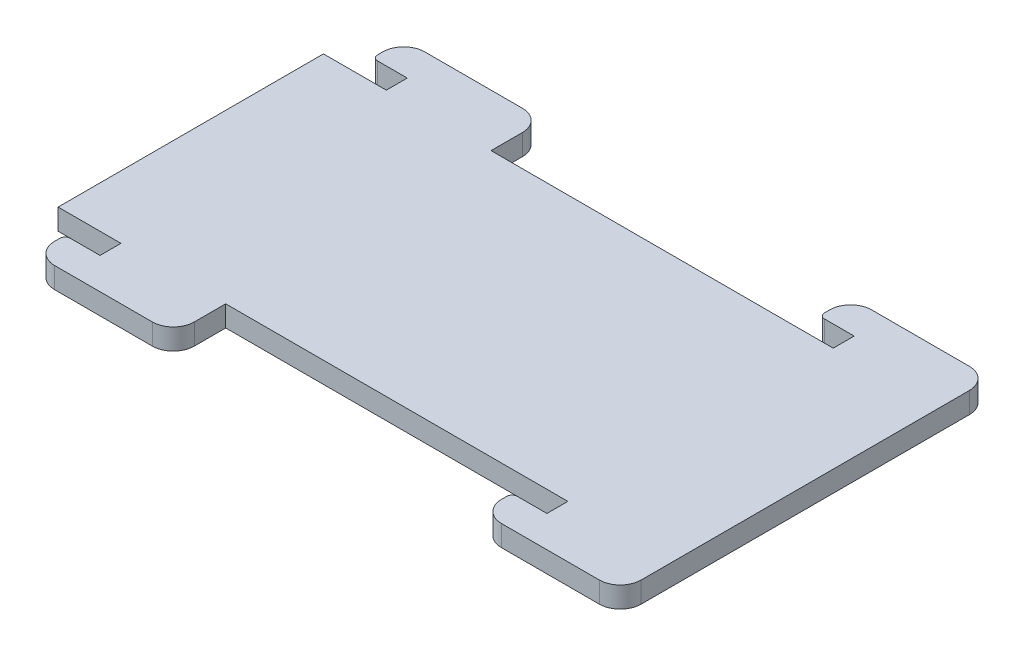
ISO-10303-21;
HEADER;
FILE_DESCRIPTION(('STEP AP214'),'2;1');
FILE_NAME('part.step','',(''),(''),'','','');
FILE_SCHEMA(('AUTOMOTIVE_DESIGN { 1 0 10303 214 1 1 1 1 }'));
ENDSEC;
DATA;
#1=APPLICATION_CONTEXT('core data for automotive mechanical design processes');
#2=APPLICATION_PROTOCOL_DEFINITION('international standard','automotive_design',2000,#1);
#3=PRODUCT_CONTEXT('',#1,'mechanical');
#4=PRODUCT('Part','Part','',(#3));
#5=PRODUCT_RELATED_PRODUCT_CATEGORY('part','',(#4));
#6=PRODUCT_DEFINITION_FORMATION('','',#4);
#7=PRODUCT_DEFINITION_CONTEXT('part definition',#1,'design');
#8=PRODUCT_DEFINITION('design','',#6,#7);
#9=PRODUCT_DEFINITION_SHAPE('','',#8);
#10=(LENGTH_UNIT() NAMED_UNIT(*) SI_UNIT(.MILLI.,.METRE.));
#11=(NAMED_UNIT(*) PLANE_ANGLE_UNIT() SI_UNIT($,.RADIAN.));
#12=(NAMED_UNIT(*) SI_UNIT($,.STERADIAN.) SOLID_ANGLE_UNIT());
#13=UNCERTAINTY_MEASURE_WITH_UNIT(LENGTH_MEASURE(1.E-05),#10,'distance_accuracy_value','');
#14=(GEOMETRIC_REPRESENTATION_CONTEXT(3) GLOBAL_UNCERTAINTY_ASSIGNED_CONTEXT((#13)) GLOBAL_UNIT_ASSIGNED_CONTEXT((#10,
#11,#12)) REPRESENTATION_CONTEXT('',''));
#15=CARTESIAN_POINT('',(0.,0.,0.));
#16=DIRECTION('',(0.,0.,1.));
#17=DIRECTION('',(1.,0.,0.));
#18=AXIS2_PLACEMENT_3D('',#15,#16,#17);
#19=CARTESIAN_POINT('',(0.,3.,0.));
#20=DIRECTION('',(1.,0.,0.));
#21=DIRECTION('',(0.,0.,-1.));
#22=AXIS2_PLACEMENT_3D('',#19,#20,#21);
#23=PLANE('',#22);
#24=DIRECTION('',(0.,0.,1.));
#25=VECTOR('',#24,1.);
#26=CARTESIAN_POINT('',(0.,0.,0.));
#27=LINE('',#26,#25);
#28=CARTESIAN_POINT('',(0.,0.,-38.));
#29=VERTEX_POINT('',#28);
#30=CARTESIAN_POINT('',(0.,0.,0.));
#31=VERTEX_POINT('',#30);
#32=EDGE_CURVE('E294',#29,#31,#27,.T.);
#33=ORIENTED_EDGE('',*,*,#32,.T.);
#34=DIRECTION('',(0.,-1.,0.));
#35=VECTOR('',#34,1.);
#36=CARTESIAN_POINT('',(0.,3.,0.));
#37=LINE('',#36,#35);
#38=CARTESIAN_POINT('',(0.,3.,0.));
#39=VERTEX_POINT('',#38);
#40=EDGE_CURVE('E275',#39,#31,#37,.T.);
#41=ORIENTED_EDGE('',*,*,#40,.F.);
#42=DIRECTION('',(0.,0.,1.));
#43=VECTOR('',#42,1.);
#44=CARTESIAN_POINT('',(0.,3.,0.));
#45=LINE('',#44,#43);
#46=CARTESIAN_POINT('',(0.,3.,-38.));
#47=VERTEX_POINT('',#46);
#48=EDGE_CURVE('E281',#47,#39,#45,.T.);
#49=ORIENTED_EDGE('',*,*,#48,.F.);
#50=DIRECTION('',(0.,-1.,0.));
#51=VECTOR('',#50,1.);
#52=CARTESIAN_POINT('',(0.,3.,-38.));
#53=LINE('',#52,#51);
#54=EDGE_CURVE('E432',#47,#29,#53,.T.);
#55=ORIENTED_EDGE('',*,*,#54,.T.);
#56=EDGE_LOOP('',(#33,#41,#49,#55));
#57=FACE_BOUND('',#56,.T.);
#58=ADVANCED_FACE('F37',(#57),#23,.F.);
#59=CARTESIAN_POINT('',(0.,3.,0.));
#60=DIRECTION('',(0.,0.,-1.));
#61=DIRECTION('',(-1.,0.,0.));
#62=AXIS2_PLACEMENT_3D('',#59,#60,#61);
#63=PLANE('',#62);
#64=DIRECTION('',(1.,0.,0.));
#65=VECTOR('',#64,1.);
#66=CARTESIAN_POINT('',(0.,0.,0.));
#67=LINE('',#66,#65);
#68=CARTESIAN_POINT('',(8.99999999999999,0.,0.));
#69=VERTEX_POINT('',#68);
#70=EDGE_CURVE('E470',#31,#69,#67,.T.);
#71=ORIENTED_EDGE('',*,*,#70,.T.);
#72=DIRECTION('',(0.,-1.,0.));
#73=VECTOR('',#72,1.);
#74=CARTESIAN_POINT('',(8.99999999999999,3.,0.));
#75=LINE('',#74,#73);
#76=CARTESIAN_POINT('',(8.99999999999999,3.,0.));
#77=VERTEX_POINT('',#76);
#78=EDGE_CURVE('E278',#77,#69,#75,.T.);
#79=ORIENTED_EDGE('',*,*,#78,.F.);
#80=DIRECTION('',(1.,0.,0.));
#81=VECTOR('',#80,1.);
#82=CARTESIAN_POINT('',(0.,3.,0.));
#83=LINE('',#82,#81);
#84=EDGE_CURVE('E271',#39,#77,#83,.T.);
#85=ORIENTED_EDGE('',*,*,#84,.F.);
#86=ORIENTED_EDGE('',*,*,#40,.T.);
#87=EDGE_LOOP('',(#71,#79,#85,#86));
#88=FACE_BOUND('',#87,.T.);
#89=ADVANCED_FACE('F273',(#88),#63,.F.);
#90=CARTESIAN_POINT('',(8.99999999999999,3.,0.));
#91=DIRECTION('',(1.,0.,0.));
#92=DIRECTION('',(0.,0.,-1.));
#93=AXIS2_PLACEMENT_3D('',#90,#91,#92);
#94=PLANE('',#93);
#95=DIRECTION('',(0.,0.,1.));
#96=VECTOR('',#95,1.);
#97=CARTESIAN_POINT('',(8.99999999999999,0.,0.));
#98=LINE('',#97,#96);
#99=CARTESIAN_POINT('',(8.99999999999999,0.,3.));
#100=VERTEX_POINT('',#99);
#101=EDGE_CURVE('E464',#69,#100,#98,.T.);
#102=ORIENTED_EDGE('',*,*,#101,.T.);
#103=DIRECTION('',(0.,-1.,0.));
#104=VECTOR('',#103,1.);
#105=CARTESIAN_POINT('',(8.99999999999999,3.,3.));
#106=LINE('',#105,#104);
#107=CARTESIAN_POINT('',(8.99999999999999,3.,3.));
#108=VERTEX_POINT('',#107);
#109=EDGE_CURVE('E299',#108,#100,#106,.T.);
#110=ORIENTED_EDGE('',*,*,#109,.F.);
#111=DIRECTION('',(0.,0.,1.));
#112=VECTOR('',#111,1.);
#113=CARTESIAN_POINT('',(8.99999999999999,3.,0.));
#114=LINE('',#113,#112);
#115=EDGE_CURVE('E280',#77,#108,#114,.T.);
#116=ORIENTED_EDGE('',*,*,#115,.F.);
#117=ORIENTED_EDGE('',*,*,#78,.T.);
#118=EDGE_LOOP('',(#102,#110,#116,#117));
#119=FACE_BOUND('',#118,.T.);
#120=ADVANCED_FACE('F536',(#119),#94,.F.);
#121=CARTESIAN_POINT('',(8.99999999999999,3.,3.));
#122=DIRECTION('',(0.,0.,1.));
#123=DIRECTION('',(1.,0.,0.));
#124=AXIS2_PLACEMENT_3D('',#121,#122,#123);
#125=PLANE('',#124);
#126=DIRECTION('',(-1.,0.,0.));
#127=VECTOR('',#126,1.);
#128=CARTESIAN_POINT('',(8.99999999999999,0.,3.));
#129=LINE('',#128,#127);
#130=CARTESIAN_POINT('',(4.75,0.,3.));
#131=VERTEX_POINT('',#130);
#132=EDGE_CURVE('E460',#100,#131,#129,.T.);
#133=ORIENTED_EDGE('',*,*,#132,.T.);
#134=DIRECTION('',(0.,-1.,0.));
#135=VECTOR('',#134,1.);
#136=CARTESIAN_POINT('',(4.75,3.,3.));
#137=LINE('',#136,#135);
#138=CARTESIAN_POINT('',(4.75,3.,3.));
#139=VERTEX_POINT('',#138);
#140=EDGE_CURVE('E60',#131,#139,#137,.F.);
#141=ORIENTED_EDGE('',*,*,#140,.T.);
#142=DIRECTION('',(-1.,0.,0.));
#143=VECTOR('',#142,1.);
#144=CARTESIAN_POINT('',(8.99999999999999,3.,3.));
#145=LINE('',#144,#143);
#146=EDGE_CURVE('E461',#108,#139,#145,.T.);
#147=ORIENTED_EDGE('',*,*,#146,.F.);
#148=ORIENTED_EDGE('',*,*,#109,.T.);
#149=EDGE_LOOP('',(#133,#141,#147,#148));
#150=FACE_BOUND('',#149,.T.);
#151=ADVANCED_FACE('F459',(#150),#125,.F.);
#152=CARTESIAN_POINT('',(4.,3.,3.));
#153=DIRECTION('',(1.,0.,0.));
#154=DIRECTION('',(0.,0.,-1.));
#155=AXIS2_PLACEMENT_3D('',#152,#153,#154);
#156=PLANE('',#155);
#157=DIRECTION('',(0.,0.,1.));
#158=VECTOR('',#157,1.);
#159=CARTESIAN_POINT('',(4.,3.,3.));
#160=LINE('',#159,#158);
#161=CARTESIAN_POINT('',(4.,3.,3.75));
#162=VERTEX_POINT('',#161);
#163=CARTESIAN_POINT('',(4.,3.,4.5));
#164=VERTEX_POINT('',#163);
#165=EDGE_CURVE('E538',#162,#164,#160,.T.);
#166=ORIENTED_EDGE('',*,*,#165,.F.);
#167=DIRECTION('',(0.,-1.,0.));
#168=VECTOR('',#167,1.);
#169=CARTESIAN_POINT('',(4.,3.,3.75));
#170=LINE('',#169,#168);
#171=CARTESIAN_POINT('',(4.,0.,3.75));
#172=VERTEX_POINT('',#171);
#173=EDGE_CURVE('E396',#162,#172,#170,.T.);
#174=ORIENTED_EDGE('',*,*,#173,.T.);
#175=DIRECTION('',(0.,0.,1.));
#176=VECTOR('',#175,1.);
#177=CARTESIAN_POINT('',(4.,0.,3.));
#178=LINE('',#177,#176);
#179=CARTESIAN_POINT('',(4.,0.,4.5));
#180=VERTEX_POINT('',#179);
#181=EDGE_CURVE('E466',#172,#180,#178,.T.);
#182=ORIENTED_EDGE('',*,*,#181,.T.);
#183=DIRECTION('',(0.,-1.,0.));
#184=VECTOR('',#183,1.);
#185=CARTESIAN_POINT('',(4.,3.,4.5));
#186=LINE('',#185,#184);
#187=EDGE_CURVE('E352',#180,#164,#186,.F.);
#188=ORIENTED_EDGE('',*,*,#187,.T.);
#189=EDGE_LOOP('',(#166,#174,#182,#188));
#190=FACE_BOUND('',#189,.T.);
#191=ADVANCED_FACE('F678',(#190),#156,.F.);
#192=CARTESIAN_POINT('',(24.,3.,7.5));
#193=DIRECTION('',(0.,0.,-1.));
#194=DIRECTION('',(-1.,0.,0.));
#195=AXIS2_PLACEMENT_3D('',#192,#193,#194);
#196=PLANE('',#195);
#197=DIRECTION('',(1.,0.,0.));
#198=VECTOR('',#197,1.);
#199=CARTESIAN_POINT('',(24.,3.,7.5));
#200=LINE('',#199,#198);
#201=CARTESIAN_POINT('',(7.,3.,7.5));
#202=VERTEX_POINT('',#201);
#203=CARTESIAN_POINT('',(21.,3.,7.5));
#204=VERTEX_POINT('',#203);
#205=EDGE_CURVE('E542',#202,#204,#200,.T.);
#206=ORIENTED_EDGE('',*,*,#205,.F.);
#207=DIRECTION('',(0.,-1.,0.));
#208=VECTOR('',#207,1.);
#209=CARTESIAN_POINT('',(7.,3.,7.5));
#210=LINE('',#209,#208);
#211=CARTESIAN_POINT('',(7.,0.,7.5));
#212=VERTEX_POINT('',#211);
#213=EDGE_CURVE('E349',#202,#212,#210,.T.);
#214=ORIENTED_EDGE('',*,*,#213,.T.);
#215=DIRECTION('',(1.,0.,0.));
#216=VECTOR('',#215,1.);
#217=CARTESIAN_POINT('',(24.,0.,7.5));
#218=LINE('',#217,#216);
#219=CARTESIAN_POINT('',(21.,0.,7.5));
#220=VERTEX_POINT('',#219);
#221=EDGE_CURVE('E468',#212,#220,#218,.T.);
#222=ORIENTED_EDGE('',*,*,#221,.T.);
#223=DIRECTION('',(0.,-1.,0.));
#224=VECTOR('',#223,1.);
#225=CARTESIAN_POINT('',(21.,3.,7.5));
#226=LINE('',#225,#224);
#227=EDGE_CURVE('E347',#220,#204,#226,.F.);
#228=ORIENTED_EDGE('',*,*,#227,.T.);
#229=EDGE_LOOP('',(#206,#214,#222,#228));
#230=FACE_BOUND('',#229,.T.);
#231=ADVANCED_FACE('F671',(#230),#196,.F.);
#232=CARTESIAN_POINT('',(24.,3.,0.));
#233=DIRECTION('',(-1.,0.,0.));
#234=DIRECTION('',(0.,0.,1.));
#235=AXIS2_PLACEMENT_3D('',#232,#233,#234);
#236=PLANE('',#235);
#237=DIRECTION('',(0.,0.,-1.));
#238=VECTOR('',#237,1.);
#239=CARTESIAN_POINT('',(24.,3.,3.));
#240=LINE('',#239,#238);
#241=CARTESIAN_POINT('',(24.,3.,4.5));
#242=VERTEX_POINT('',#241);
#243=CARTESIAN_POINT('',(24.,3.,0.));
#244=VERTEX_POINT('',#243);
#245=EDGE_CURVE('E545',#242,#244,#240,.T.);
#246=ORIENTED_EDGE('',*,*,#245,.F.);
#247=DIRECTION('',(0.,-1.,0.));
#248=VECTOR('',#247,1.);
#249=CARTESIAN_POINT('',(24.,3.,4.5));
#250=LINE('',#249,#248);
#251=CARTESIAN_POINT('',(24.,0.,4.5));
#252=VERTEX_POINT('',#251);
#253=EDGE_CURVE('E355',#242,#252,#250,.T.);
#254=ORIENTED_EDGE('',*,*,#253,.T.);
#255=DIRECTION('',(0.,0.,-1.));
#256=VECTOR('',#255,1.);
#257=CARTESIAN_POINT('',(24.,0.,0.));
#258=LINE('',#257,#256);
#259=CARTESIAN_POINT('',(24.,0.,0.));
#260=VERTEX_POINT('',#259);
#261=EDGE_CURVE('E476',#252,#260,#258,.T.);
#262=ORIENTED_EDGE('',*,*,#261,.T.);
#263=DIRECTION('',(0.,-1.,0.));
#264=VECTOR('',#263,1.);
#265=CARTESIAN_POINT('',(24.,3.,0.));
#266=LINE('',#265,#264);
#267=EDGE_CURVE('E454',#244,#260,#266,.T.);
#268=ORIENTED_EDGE('',*,*,#267,.F.);
#269=EDGE_LOOP('',(#246,#254,#262,#268));
#270=FACE_BOUND('',#269,.T.);
#271=ADVANCED_FACE('F662',(#270),#236,.F.);
#272=CARTESIAN_POINT('',(24.,3.,0.));
#273=DIRECTION('',(0.,0.,-1.));
#274=DIRECTION('',(-1.,0.,0.));
#275=AXIS2_PLACEMENT_3D('',#272,#273,#274);
#276=PLANE('',#275);
#277=DIRECTION('',(1.,0.,0.));
#278=VECTOR('',#277,1.);
#279=CARTESIAN_POINT('',(24.,0.,0.));
#280=LINE('',#279,#278);
#281=CARTESIAN_POINT('',(73.,0.,0.));
#282=VERTEX_POINT('',#281);
#283=EDGE_CURVE('E478',#260,#282,#280,.T.);
#284=ORIENTED_EDGE('',*,*,#283,.T.);
#285=DIRECTION('',(0.,-1.,0.));
#286=VECTOR('',#285,1.);
#287=CARTESIAN_POINT('',(73.,3.,0.));
#288=LINE('',#287,#286);
#289=CARTESIAN_POINT('',(73.,3.,0.));
#290=VERTEX_POINT('',#289);
#291=EDGE_CURVE('E451',#290,#282,#288,.T.);
#292=ORIENTED_EDGE('',*,*,#291,.F.);
#293=DIRECTION('',(1.,0.,0.));
#294=VECTOR('',#293,1.);
#295=CARTESIAN_POINT('',(24.,3.,0.));
#296=LINE('',#295,#294);
#297=EDGE_CURVE('E547',#244,#290,#296,.T.);
#298=ORIENTED_EDGE('',*,*,#297,.F.);
#299=ORIENTED_EDGE('',*,*,#267,.T.);
#300=EDGE_LOOP('',(#284,#292,#298,#299));
#301=FACE_BOUND('',#300,.T.);
#302=ADVANCED_FACE('F658',(#301),#276,.F.);
#303=CARTESIAN_POINT('',(73.,3.,0.));
#304=DIRECTION('',(1.,0.,0.));
#305=DIRECTION('',(0.,0.,-1.));
#306=AXIS2_PLACEMENT_3D('',#303,#304,#305);
#307=PLANE('',#306);
#308=DIRECTION('',(0.,0.,1.));
#309=VECTOR('',#308,1.);
#310=CARTESIAN_POINT('',(73.,0.,0.));
#311=LINE('',#310,#309);
#312=CARTESIAN_POINT('',(73.,0.,3.));
#313=VERTEX_POINT('',#312);
#314=EDGE_CURVE('E480',#282,#313,#311,.T.);
#315=ORIENTED_EDGE('',*,*,#314,.T.);
#316=DIRECTION('',(0.,-1.,0.));
#317=VECTOR('',#316,1.);
#318=CARTESIAN_POINT('',(73.,3.,3.));
#319=LINE('',#318,#317);
#320=CARTESIAN_POINT('',(73.,3.,3.));
#321=VERTEX_POINT('',#320);
#322=EDGE_CURVE('E448',#321,#313,#319,.T.);
#323=ORIENTED_EDGE('',*,*,#322,.F.);
#324=DIRECTION('',(0.,0.,1.));
#325=VECTOR('',#324,1.);
#326=CARTESIAN_POINT('',(73.,3.,0.));
#327=LINE('',#326,#325);
#328=EDGE_CURVE('E549',#290,#321,#327,.T.);
#329=ORIENTED_EDGE('',*,*,#328,.F.);
#330=ORIENTED_EDGE('',*,*,#291,.T.);
#331=EDGE_LOOP('',(#315,#323,#329,#330));
#332=FACE_BOUND('',#331,.T.);
#333=ADVANCED_FACE('F653',(#332),#307,.F.);
#334=CARTESIAN_POINT('',(73.,3.,3.));
#335=DIRECTION('',(0.,0.,1.));
#336=DIRECTION('',(1.,0.,0.));
#337=AXIS2_PLACEMENT_3D('',#334,#335,#336);
#338=PLANE('',#337);
#339=DIRECTION('',(-1.,0.,0.));
#340=VECTOR('',#339,1.);
#341=CARTESIAN_POINT('',(73.,0.,3.));
#342=LINE('',#341,#340);
#343=CARTESIAN_POINT('',(68.75,0.,3.));
#344=VERTEX_POINT('',#343);
#345=EDGE_CURVE('E482',#313,#344,#342,.T.);
#346=ORIENTED_EDGE('',*,*,#345,.T.);
#347=DIRECTION('',(0.,-1.,0.));
#348=VECTOR('',#347,1.);
#349=CARTESIAN_POINT('',(68.75,3.,3.));
#350=LINE('',#349,#348);
#351=CARTESIAN_POINT('',(68.75,3.,3.));
#352=VERTEX_POINT('',#351);
#353=EDGE_CURVE('E387',#344,#352,#350,.F.);
#354=ORIENTED_EDGE('',*,*,#353,.T.);
#355=DIRECTION('',(-1.,0.,0.));
#356=VECTOR('',#355,1.);
#357=CARTESIAN_POINT('',(73.,3.,3.));
#358=LINE('',#357,#356);
#359=EDGE_CURVE('E551',#321,#352,#358,.T.);
#360=ORIENTED_EDGE('',*,*,#359,.F.);
#361=ORIENTED_EDGE('',*,*,#322,.T.);
#362=EDGE_LOOP('',(#346,#354,#360,#361));
#363=FACE_BOUND('',#362,.T.);
#364=ADVANCED_FACE('F647',(#363),#338,.F.);
#365=CARTESIAN_POINT('',(68.,3.,3.));
#366=DIRECTION('',(1.,0.,0.));
#367=DIRECTION('',(0.,0.,-1.));
#368=AXIS2_PLACEMENT_3D('',#365,#366,#367);
#369=PLANE('',#368);
#370=DIRECTION('',(0.,0.,1.));
#371=VECTOR('',#370,1.);
#372=CARTESIAN_POINT('',(68.,3.,3.));
#373=LINE('',#372,#371);
#374=CARTESIAN_POINT('',(68.,3.,3.75));
#375=VERTEX_POINT('',#374);
#376=CARTESIAN_POINT('',(68.,3.,4.5));
#377=VERTEX_POINT('',#376);
#378=EDGE_CURVE('E553',#375,#377,#373,.T.);
#379=ORIENTED_EDGE('',*,*,#378,.F.);
#380=DIRECTION('',(0.,-1.,0.));
#381=VECTOR('',#380,1.);
#382=CARTESIAN_POINT('',(68.,3.,3.75));
#383=LINE('',#382,#381);
#384=CARTESIAN_POINT('',(68.,0.,3.75));
#385=VERTEX_POINT('',#384);
#386=EDGE_CURVE('E376',#375,#385,#383,.T.);
#387=ORIENTED_EDGE('',*,*,#386,.T.);
#388=DIRECTION('',(0.,0.,1.));
#389=VECTOR('',#388,1.);
#390=CARTESIAN_POINT('',(68.,0.,3.));
#391=LINE('',#390,#389);
#392=CARTESIAN_POINT('',(68.,0.,4.5));
#393=VERTEX_POINT('',#392);
#394=EDGE_CURVE('E485',#385,#393,#391,.T.);
#395=ORIENTED_EDGE('',*,*,#394,.T.);
#396=DIRECTION('',(0.,-1.,0.));
#397=VECTOR('',#396,1.);
#398=CARTESIAN_POINT('',(68.,3.,4.5));
#399=LINE('',#398,#397);
#400=EDGE_CURVE('E344',#393,#377,#399,.F.);
#401=ORIENTED_EDGE('',*,*,#400,.T.);
#402=EDGE_LOOP('',(#379,#387,#395,#401));
#403=FACE_BOUND('',#402,.T.);
#404=ADVANCED_FACE('F639',(#403),#369,.F.);
#405=CARTESIAN_POINT('',(88.,3.,7.5));
#406=DIRECTION('',(0.,0.,-1.));
#407=DIRECTION('',(-1.,0.,0.));
#408=AXIS2_PLACEMENT_3D('',#405,#406,#407);
#409=PLANE('',#408);
#410=DIRECTION('',(1.,0.,0.));
#411=VECTOR('',#410,1.);
#412=CARTESIAN_POINT('',(88.,0.,7.5));
#413=LINE('',#412,#411);
#414=CARTESIAN_POINT('',(71.,0.,7.5));
#415=VERTEX_POINT('',#414);
#416=CARTESIAN_POINT('',(85.,0.,7.5));
#417=VERTEX_POINT('',#416);
#418=EDGE_CURVE('E487',#415,#417,#413,.T.);
#419=ORIENTED_EDGE('',*,*,#418,.T.);
#420=DIRECTION('',(0.,-1.,0.));
#421=VECTOR('',#420,1.);
#422=CARTESIAN_POINT('',(85.,3.,7.5));
#423=LINE('',#422,#421);
#424=CARTESIAN_POINT('',(85.,3.,7.5));
#425=VERTEX_POINT('',#424);
#426=EDGE_CURVE('E326',#417,#425,#423,.F.);
#427=ORIENTED_EDGE('',*,*,#426,.T.);
#428=DIRECTION('',(1.,0.,0.));
#429=VECTOR('',#428,1.);
#430=CARTESIAN_POINT('',(88.,3.,7.5));
#431=LINE('',#430,#429);
#432=CARTESIAN_POINT('',(71.,3.,7.5));
#433=VERTEX_POINT('',#432);
#434=EDGE_CURVE('E555',#433,#425,#431,.T.);
#435=ORIENTED_EDGE('',*,*,#434,.F.);
#436=DIRECTION('',(0.,-1.,0.));
#437=VECTOR('',#436,1.);
#438=CARTESIAN_POINT('',(71.,3.,7.5));
#439=LINE('',#438,#437);
#440=EDGE_CURVE('E323',#433,#415,#439,.T.);
#441=ORIENTED_EDGE('',*,*,#440,.T.);
#442=EDGE_LOOP('',(#419,#427,#435,#441));
#443=FACE_BOUND('',#442,.T.);
#444=ADVANCED_FACE('F629',(#443),#409,.F.);
#445=CARTESIAN_POINT('',(88.,3.,-41.));
#446=DIRECTION('',(-1.,0.,0.));
#447=DIRECTION('',(0.,0.,1.));
#448=AXIS2_PLACEMENT_3D('',#445,#446,#447);
#449=PLANE('',#448);
#450=DIRECTION('',(0.,0.,-1.));
#451=VECTOR('',#450,1.);
#452=CARTESIAN_POINT('',(88.,3.,3.));
#453=LINE('',#452,#451);
#454=CARTESIAN_POINT('',(88.,3.,4.5));
#455=VERTEX_POINT('',#454);
#456=CARTESIAN_POINT('',(88.,3.,-42.5));
#457=VERTEX_POINT('',#456);
#458=EDGE_CURVE('E558',#455,#457,#453,.T.);
#459=ORIENTED_EDGE('',*,*,#458,.F.);
#460=DIRECTION('',(0.,-1.,0.));
#461=VECTOR('',#460,1.);
#462=CARTESIAN_POINT('',(88.,3.,4.5));
#463=LINE('',#462,#461);
#464=CARTESIAN_POINT('',(88.,0.,4.5));
#465=VERTEX_POINT('',#464);
#466=EDGE_CURVE('E297',#455,#465,#463,.T.);
#467=ORIENTED_EDGE('',*,*,#466,.T.);
#468=DIRECTION('',(0.,0.,-1.));
#469=VECTOR('',#468,1.);
#470=CARTESIAN_POINT('',(88.,0.,-41.));
#471=LINE('',#470,#469);
#472=CARTESIAN_POINT('',(88.,0.,-42.5));
#473=VERTEX_POINT('',#472);
#474=EDGE_CURVE('E490',#465,#473,#471,.T.);
#475=ORIENTED_EDGE('',*,*,#474,.T.);
#476=DIRECTION('',(0.,-1.,0.));
#477=VECTOR('',#476,1.);
#478=CARTESIAN_POINT('',(88.,3.,-42.5));
#479=LINE('',#478,#477);
#480=EDGE_CURVE('E295',#473,#457,#479,.F.);
#481=ORIENTED_EDGE('',*,*,#480,.T.);
#482=EDGE_LOOP('',(#459,#467,#475,#481));
#483=FACE_BOUND('',#482,.T.);
#484=ADVANCED_FACE('F621',(#483),#449,.F.);
#485=CARTESIAN_POINT('',(88.,3.,-45.5));
#486=DIRECTION('',(0.,0.,1.));
#487=DIRECTION('',(1.,0.,0.));
#488=AXIS2_PLACEMENT_3D('',#485,#486,#487);
#489=PLANE('',#488);
#490=DIRECTION('',(-1.,0.,0.));
#491=VECTOR('',#490,1.);
#492=CARTESIAN_POINT('',(88.,3.,-45.5));
#493=LINE('',#492,#491);
#494=CARTESIAN_POINT('',(85.,3.,-45.5));
#495=VERTEX_POINT('',#494);
#496=CARTESIAN_POINT('',(71.,3.,-45.5));
#497=VERTEX_POINT('',#496);
#498=EDGE_CURVE('E561',#495,#497,#493,.T.);
#499=ORIENTED_EDGE('',*,*,#498,.F.);
#500=DIRECTION('',(0.,-1.,0.));
#501=VECTOR('',#500,1.);
#502=CARTESIAN_POINT('',(85.,3.,-45.5));
#503=LINE('',#502,#501);
#504=CARTESIAN_POINT('',(85.,0.,-45.5));
#505=VERTEX_POINT('',#504);
#506=EDGE_CURVE('E368',#495,#505,#503,.T.);
#507=ORIENTED_EDGE('',*,*,#506,.T.);
#508=DIRECTION('',(-1.,0.,0.));
#509=VECTOR('',#508,1.);
#510=CARTESIAN_POINT('',(88.,0.,-45.5));
#511=LINE('',#510,#509);
#512=CARTESIAN_POINT('',(71.,0.,-45.5));
#513=VERTEX_POINT('',#512);
#514=EDGE_CURVE('E493',#505,#513,#511,.T.);
#515=ORIENTED_EDGE('',*,*,#514,.T.);
#516=DIRECTION('',(0.,-1.,0.));
#517=VECTOR('',#516,1.);
#518=CARTESIAN_POINT('',(71.,3.,-45.5));
#519=LINE('',#518,#517);
#520=EDGE_CURVE('E366',#513,#497,#519,.F.);
#521=ORIENTED_EDGE('',*,*,#520,.T.);
#522=EDGE_LOOP('',(#499,#507,#515,#521));
#523=FACE_BOUND('',#522,.T.);
#524=ADVANCED_FACE('F612',(#523),#489,.F.);
#525=CARTESIAN_POINT('',(68.,3.,-41.));
#526=DIRECTION('',(1.,0.,0.));
#527=DIRECTION('',(0.,0.,-1.));
#528=AXIS2_PLACEMENT_3D('',#525,#526,#527);
#529=PLANE('',#528);
#530=DIRECTION('',(0.,0.,1.));
#531=VECTOR('',#530,1.);
#532=CARTESIAN_POINT('',(68.,0.,-41.));
#533=LINE('',#532,#531);
#534=CARTESIAN_POINT('',(68.,0.,-42.5));
#535=VERTEX_POINT('',#534);
#536=CARTESIAN_POINT('',(68.,0.,-41.75));
#537=VERTEX_POINT('',#536);
#538=EDGE_CURVE('E496',#535,#537,#533,.T.);
#539=ORIENTED_EDGE('',*,*,#538,.T.);
#540=DIRECTION('',(0.,-1.,0.));
#541=VECTOR('',#540,1.);
#542=CARTESIAN_POINT('',(68.,3.,-41.75));
#543=LINE('',#542,#541);
#544=CARTESIAN_POINT('',(68.,3.,-41.75));
#545=VERTEX_POINT('',#544);
#546=EDGE_CURVE('E403',#537,#545,#543,.F.);
#547=ORIENTED_EDGE('',*,*,#546,.T.);
#548=DIRECTION('',(0.,0.,1.));
#549=VECTOR('',#548,1.);
#550=CARTESIAN_POINT('',(68.,3.,-41.));
#551=LINE('',#550,#549);
#552=CARTESIAN_POINT('',(68.,3.,-42.5));
#553=VERTEX_POINT('',#552);
#554=EDGE_CURVE('E564',#553,#545,#551,.T.);
#555=ORIENTED_EDGE('',*,*,#554,.F.);
#556=DIRECTION('',(0.,-1.,0.));
#557=VECTOR('',#556,1.);
#558=CARTESIAN_POINT('',(68.,3.,-42.5));
#559=LINE('',#558,#557);
#560=EDGE_CURVE('E371',#553,#535,#559,.T.);
#561=ORIENTED_EDGE('',*,*,#560,.T.);
#562=EDGE_LOOP('',(#539,#547,#555,#561));
#563=FACE_BOUND('',#562,.T.);
#564=ADVANCED_FACE('F602',(#563),#529,.F.);
#565=CARTESIAN_POINT('',(73.,3.,-41.));
#566=DIRECTION('',(0.,0.,-1.));
#567=DIRECTION('',(-1.,0.,0.));
#568=AXIS2_PLACEMENT_3D('',#565,#566,#567);
#569=PLANE('',#568);
#570=DIRECTION('',(1.,0.,0.));
#571=VECTOR('',#570,1.);
#572=CARTESIAN_POINT('',(73.,3.,-41.));
#573=LINE('',#572,#571);
#574=CARTESIAN_POINT('',(68.75,3.,-41.));
#575=VERTEX_POINT('',#574);
#576=CARTESIAN_POINT('',(73.,3.,-41.));
#577=VERTEX_POINT('',#576);
#578=EDGE_CURVE('E567',#575,#577,#573,.T.);
#579=ORIENTED_EDGE('',*,*,#578,.F.);
#580=DIRECTION('',(0.,-1.,0.));
#581=VECTOR('',#580,1.);
#582=CARTESIAN_POINT('',(68.75,3.,-41.));
#583=LINE('',#582,#581);
#584=CARTESIAN_POINT('',(68.75,0.,-41.));
#585=VERTEX_POINT('',#584);
#586=EDGE_CURVE('E400',#575,#585,#583,.T.);
#587=ORIENTED_EDGE('',*,*,#586,.T.);
#588=DIRECTION('',(1.,0.,0.));
#589=VECTOR('',#588,1.);
#590=CARTESIAN_POINT('',(73.,0.,-41.));
#591=LINE('',#590,#589);
#592=CARTESIAN_POINT('',(73.,0.,-41.));
#593=VERTEX_POINT('',#592);
#594=EDGE_CURVE('E499',#585,#593,#591,.T.);
#595=ORIENTED_EDGE('',*,*,#594,.T.);
#596=DIRECTION('',(0.,-1.,0.));
#597=VECTOR('',#596,1.);
#598=CARTESIAN_POINT('',(73.,3.,-41.));
#599=LINE('',#598,#597);
#600=EDGE_CURVE('E445',#577,#593,#599,.T.);
#601=ORIENTED_EDGE('',*,*,#600,.F.);
#602=EDGE_LOOP('',(#579,#587,#595,#601));
#603=FACE_BOUND('',#602,.T.);
#604=ADVANCED_FACE('F594',(#603),#569,.F.);
#605=CARTESIAN_POINT('',(73.,3.,-38.));
#606=DIRECTION('',(1.,0.,0.));
#607=DIRECTION('',(0.,0.,-1.));
#608=AXIS2_PLACEMENT_3D('',#605,#606,#607);
#609=PLANE('',#608);
#610=DIRECTION('',(0.,0.,1.));
#611=VECTOR('',#610,1.);
#612=CARTESIAN_POINT('',(73.,0.,-38.));
#613=LINE('',#612,#611);
#614=CARTESIAN_POINT('',(73.,0.,-38.));
#615=VERTEX_POINT('',#614);
#616=EDGE_CURVE('E501',#593,#615,#613,.T.);
#617=ORIENTED_EDGE('',*,*,#616,.T.);
#618=DIRECTION('',(0.,-1.,0.));
#619=VECTOR('',#618,1.);
#620=CARTESIAN_POINT('',(73.,3.,-38.));
#621=LINE('',#620,#619);
#622=CARTESIAN_POINT('',(73.,3.,-38.));
#623=VERTEX_POINT('',#622);
#624=EDGE_CURVE('E442',#623,#615,#621,.T.);
#625=ORIENTED_EDGE('',*,*,#624,.F.);
#626=DIRECTION('',(0.,0.,1.));
#627=VECTOR('',#626,1.);
#628=CARTESIAN_POINT('',(73.,3.,-38.));
#629=LINE('',#628,#627);
#630=EDGE_CURVE('E569',#577,#623,#629,.T.);
#631=ORIENTED_EDGE('',*,*,#630,.F.);
#632=ORIENTED_EDGE('',*,*,#600,.T.);
#633=EDGE_LOOP('',(#617,#625,#631,#632));
#634=FACE_BOUND('',#633,.T.);
#635=ADVANCED_FACE('F589',(#634),#609,.F.);
#636=CARTESIAN_POINT('',(24.,3.,-38.));
#637=DIRECTION('',(0.,0.,1.));
#638=DIRECTION('',(1.,0.,0.));
#639=AXIS2_PLACEMENT_3D('',#636,#637,#638);
#640=PLANE('',#639);
#641=DIRECTION('',(-1.,0.,0.));
#642=VECTOR('',#641,1.);
#643=CARTESIAN_POINT('',(24.,0.,-38.));
#644=LINE('',#643,#642);
#645=CARTESIAN_POINT('',(24.,0.,-38.));
#646=VERTEX_POINT('',#645);
#647=EDGE_CURVE('E503',#615,#646,#644,.T.);
#648=ORIENTED_EDGE('',*,*,#647,.T.);
#649=DIRECTION('',(0.,-1.,0.));
#650=VECTOR('',#649,1.);
#651=CARTESIAN_POINT('',(24.,3.,-38.));
#652=LINE('',#651,#650);
#653=CARTESIAN_POINT('',(24.,3.,-38.));
#654=VERTEX_POINT('',#653);
#655=EDGE_CURVE('E439',#654,#646,#652,.T.);
#656=ORIENTED_EDGE('',*,*,#655,.F.);
#657=DIRECTION('',(-1.,0.,0.));
#658=VECTOR('',#657,1.);
#659=CARTESIAN_POINT('',(24.,3.,-38.));
#660=LINE('',#659,#658);
#661=EDGE_CURVE('E571',#623,#654,#660,.T.);
#662=ORIENTED_EDGE('',*,*,#661,.F.);
#663=ORIENTED_EDGE('',*,*,#624,.T.);
#664=EDGE_LOOP('',(#648,#656,#662,#663));
#665=FACE_BOUND('',#664,.T.);
#666=ADVANCED_FACE('F584',(#665),#640,.F.);
#667=CARTESIAN_POINT('',(24.,3.,-41.));
#668=DIRECTION('',(-1.,0.,0.));
#669=DIRECTION('',(0.,0.,1.));
#670=AXIS2_PLACEMENT_3D('',#667,#668,#669);
#671=PLANE('',#670);
#672=DIRECTION('',(0.,0.,-1.));
#673=VECTOR('',#672,1.);
#674=CARTESIAN_POINT('',(24.,0.,-41.));
#675=LINE('',#674,#673);
#676=CARTESIAN_POINT('',(24.,0.,-42.5));
#677=VERTEX_POINT('',#676);
#678=EDGE_CURVE('E506',#646,#677,#675,.T.);
#679=ORIENTED_EDGE('',*,*,#678,.T.);
#680=DIRECTION('',(0.,-1.,0.));
#681=VECTOR('',#680,1.);
#682=CARTESIAN_POINT('',(24.,3.,-42.5));
#683=LINE('',#682,#681);
#684=CARTESIAN_POINT('',(24.,3.,-42.5));
#685=VERTEX_POINT('',#684);
#686=EDGE_CURVE('E374',#677,#685,#683,.F.);
#687=ORIENTED_EDGE('',*,*,#686,.T.);
#688=DIRECTION('',(0.,0.,-1.));
#689=VECTOR('',#688,1.);
#690=CARTESIAN_POINT('',(24.,3.,-38.));
#691=LINE('',#690,#689);
#692=EDGE_CURVE('E530',#654,#685,#691,.T.);
#693=ORIENTED_EDGE('',*,*,#692,.F.);
#694=ORIENTED_EDGE('',*,*,#655,.T.);
#695=EDGE_LOOP('',(#679,#687,#693,#694));
#696=FACE_BOUND('',#695,.T.);
#697=ADVANCED_FACE('F582',(#696),#671,.F.);
#698=CARTESIAN_POINT('',(24.,3.,-45.5));
#699=DIRECTION('',(0.,0.,1.));
#700=DIRECTION('',(1.,0.,0.));
#701=AXIS2_PLACEMENT_3D('',#698,#699,#700);
#702=PLANE('',#701);
#703=DIRECTION('',(-1.,0.,0.));
#704=VECTOR('',#703,1.);
#705=CARTESIAN_POINT('',(24.,0.,-45.5));
#706=LINE('',#705,#704);
#707=CARTESIAN_POINT('',(21.,0.,-45.5));
#708=VERTEX_POINT('',#707);
#709=CARTESIAN_POINT('',(7.,0.,-45.5));
#710=VERTEX_POINT('',#709);
#711=EDGE_CURVE('E427',#708,#710,#706,.T.);
#712=ORIENTED_EDGE('',*,*,#711,.T.);
#713=DIRECTION('',(0.,-1.,0.));
#714=VECTOR('',#713,1.);
#715=CARTESIAN_POINT('',(7.,3.,-45.5));
#716=LINE('',#715,#714);
#717=CARTESIAN_POINT('',(7.,3.,-45.5));
#718=VERTEX_POINT('',#717);
#719=EDGE_CURVE('E364',#710,#718,#716,.F.);
#720=ORIENTED_EDGE('',*,*,#719,.T.);
#721=DIRECTION('',(-1.,0.,0.));
#722=VECTOR('',#721,1.);
#723=CARTESIAN_POINT('',(24.,3.,-45.5));
#724=LINE('',#723,#722);
#725=CARTESIAN_POINT('',(21.,3.,-45.5));
#726=VERTEX_POINT('',#725);
#727=EDGE_CURVE('E523',#726,#718,#724,.T.);
#728=ORIENTED_EDGE('',*,*,#727,.F.);
#729=DIRECTION('',(0.,-1.,0.));
#730=VECTOR('',#729,1.);
#731=CARTESIAN_POINT('',(21.,3.,-45.5));
#732=LINE('',#731,#730);
#733=EDGE_CURVE('E361',#726,#708,#732,.T.);
#734=ORIENTED_EDGE('',*,*,#733,.T.);
#735=EDGE_LOOP('',(#712,#720,#728,#734));
#736=FACE_BOUND('',#735,.T.);
#737=ADVANCED_FACE('F512',(#736),#702,.F.);
#738=CARTESIAN_POINT('',(4.,3.,-41.));
#739=DIRECTION('',(1.,0.,0.));
#740=DIRECTION('',(0.,0.,-1.));
#741=AXIS2_PLACEMENT_3D('',#738,#739,#740);
#742=PLANE('',#741);
#743=DIRECTION('',(0.,0.,1.));
#744=VECTOR('',#743,1.);
#745=CARTESIAN_POINT('',(4.,0.,-41.));
#746=LINE('',#745,#744);
#747=CARTESIAN_POINT('',(4.,0.,-42.5));
#748=VERTEX_POINT('',#747);
#749=CARTESIAN_POINT('',(4.,0.,-41.75));
#750=VERTEX_POINT('',#749);
#751=EDGE_CURVE('E424',#748,#750,#746,.T.);
#752=ORIENTED_EDGE('',*,*,#751,.T.);
#753=DIRECTION('',(0.,-1.,0.));
#754=VECTOR('',#753,1.);
#755=CARTESIAN_POINT('',(4.,3.,-41.75));
#756=LINE('',#755,#754);
#757=CARTESIAN_POINT('',(4.,3.,-41.75));
#758=VERTEX_POINT('',#757);
#759=EDGE_CURVE('E11',#750,#758,#756,.F.);
#760=ORIENTED_EDGE('',*,*,#759,.T.);
#761=DIRECTION('',(0.,0.,1.));
#762=VECTOR('',#761,1.);
#763=CARTESIAN_POINT('',(4.,3.,-41.));
#764=LINE('',#763,#762);
#765=CARTESIAN_POINT('',(4.,3.,-42.5));
#766=VERTEX_POINT('',#765);
#767=EDGE_CURVE('E522',#766,#758,#764,.T.);
#768=ORIENTED_EDGE('',*,*,#767,.F.);
#769=DIRECTION('',(0.,-1.,0.));
#770=VECTOR('',#769,1.);
#771=CARTESIAN_POINT('',(4.,3.,-42.5));
#772=LINE('',#771,#770);
#773=EDGE_CURVE('E358',#766,#748,#772,.T.);
#774=ORIENTED_EDGE('',*,*,#773,.T.);
#775=EDGE_LOOP('',(#752,#760,#768,#774));
#776=FACE_BOUND('',#775,.T.);
#777=ADVANCED_FACE('F525',(#776),#742,.F.);
#778=CARTESIAN_POINT('',(8.99999999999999,3.,-41.));
#779=DIRECTION('',(0.,0.,-1.));
#780=DIRECTION('',(-1.,0.,0.));
#781=AXIS2_PLACEMENT_3D('',#778,#779,#780);
#782=PLANE('',#781);
#783=DIRECTION('',(1.,0.,0.));
#784=VECTOR('',#783,1.);
#785=CARTESIAN_POINT('',(8.99999999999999,3.,-41.));
#786=LINE('',#785,#784);
#787=CARTESIAN_POINT('',(4.75,3.,-41.));
#788=VERTEX_POINT('',#787);
#789=CARTESIAN_POINT('',(8.99999999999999,3.,-41.));
#790=VERTEX_POINT('',#789);
#791=EDGE_CURVE('E413',#788,#790,#786,.T.);
#792=ORIENTED_EDGE('',*,*,#791,.F.);
#793=DIRECTION('',(0.,-1.,0.));
#794=VECTOR('',#793,1.);
#795=CARTESIAN_POINT('',(4.75,3.,-41.));
#796=LINE('',#795,#794);
#797=CARTESIAN_POINT('',(4.75,0.,-41.));
#798=VERTEX_POINT('',#797);
#799=EDGE_CURVE('E45',#788,#798,#796,.T.);
#800=ORIENTED_EDGE('',*,*,#799,.T.);
#801=DIRECTION('',(1.,0.,0.));
#802=VECTOR('',#801,1.);
#803=CARTESIAN_POINT('',(8.99999999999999,0.,-41.));
#804=LINE('',#803,#802);
#805=CARTESIAN_POINT('',(8.99999999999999,0.,-41.));
#806=VERTEX_POINT('',#805);
#807=EDGE_CURVE('E411',#798,#806,#804,.T.);
#808=ORIENTED_EDGE('',*,*,#807,.T.);
#809=DIRECTION('',(0.,-1.,0.));
#810=VECTOR('',#809,1.);
#811=CARTESIAN_POINT('',(8.99999999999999,3.,-41.));
#812=LINE('',#811,#810);
#813=EDGE_CURVE('E437',#790,#806,#812,.T.);
#814=ORIENTED_EDGE('',*,*,#813,.F.);
#815=EDGE_LOOP('',(#792,#800,#808,#814));
#816=FACE_BOUND('',#815,.T.);
#817=ADVANCED_FACE('F409',(#816),#782,.F.);
#818=CARTESIAN_POINT('',(8.99999999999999,3.,-38.));
#819=DIRECTION('',(1.,0.,0.));
#820=DIRECTION('',(0.,0.,-1.));
#821=AXIS2_PLACEMENT_3D('',#818,#819,#820);
#822=PLANE('',#821);
#823=DIRECTION('',(0.,0.,1.));
#824=VECTOR('',#823,1.);
#825=CARTESIAN_POINT('',(8.99999999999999,0.,-38.));
#826=LINE('',#825,#824);
#827=CARTESIAN_POINT('',(8.99999999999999,0.,-38.));
#828=VERTEX_POINT('',#827);
#829=EDGE_CURVE('E423',#806,#828,#826,.T.);
#830=ORIENTED_EDGE('',*,*,#829,.T.);
#831=DIRECTION('',(0.,-1.,0.));
#832=VECTOR('',#831,1.);
#833=CARTESIAN_POINT('',(8.99999999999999,3.,-38.));
#834=LINE('',#833,#832);
#835=CARTESIAN_POINT('',(8.99999999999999,3.,-38.));
#836=VERTEX_POINT('',#835);
#837=EDGE_CURVE('E434',#836,#828,#834,.T.);
#838=ORIENTED_EDGE('',*,*,#837,.F.);
#839=DIRECTION('',(0.,0.,1.));
#840=VECTOR('',#839,1.);
#841=CARTESIAN_POINT('',(8.99999999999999,3.,-38.));
#842=LINE('',#841,#840);
#843=EDGE_CURVE('E528',#790,#836,#842,.T.);
#844=ORIENTED_EDGE('',*,*,#843,.F.);
#845=ORIENTED_EDGE('',*,*,#813,.T.);
#846=EDGE_LOOP('',(#830,#838,#844,#845));
#847=FACE_BOUND('',#846,.T.);
#848=ADVANCED_FACE('F750',(#847),#822,.F.);
#849=CARTESIAN_POINT('',(0.,3.,-38.));
#850=DIRECTION('',(0.,0.,1.));
#851=DIRECTION('',(1.,0.,0.));
#852=AXIS2_PLACEMENT_3D('',#849,#850,#851);
#853=PLANE('',#852);
#854=DIRECTION('',(-1.,0.,0.));
#855=VECTOR('',#854,1.);
#856=CARTESIAN_POINT('',(0.,0.,-38.));
#857=LINE('',#856,#855);
#858=EDGE_CURVE('E291',#828,#29,#857,.T.);
#859=ORIENTED_EDGE('',*,*,#858,.T.);
#860=ORIENTED_EDGE('',*,*,#54,.F.);
#861=DIRECTION('',(-1.,0.,0.));
#862=VECTOR('',#861,1.);
#863=CARTESIAN_POINT('',(0.,3.,-38.));
#864=LINE('',#863,#862);
#865=EDGE_CURVE('E287',#836,#47,#864,.T.);
#866=ORIENTED_EDGE('',*,*,#865,.F.);
#867=ORIENTED_EDGE('',*,*,#837,.T.);
#868=EDGE_LOOP('',(#859,#860,#866,#867));
#869=FACE_BOUND('',#868,.T.);
#870=ADVANCED_FACE('F752',(#869),#853,.F.);
#871=CARTESIAN_POINT('',(0.,3.,0.));
#872=DIRECTION('',(0.,-1.,0.));
#873=DIRECTION('',(0.,0.,-1.));
#874=AXIS2_PLACEMENT_3D('',#871,#872,#873);
#875=PLANE('',#874);
#876=ORIENTED_EDGE('',*,*,#359,.T.);
#877=CARTESIAN_POINT('',(68.75,3.,3.75));
#878=DIRECTION('',(0.,-1.,0.));
#879=DIRECTION('',(0.,0.,-1.));
#880=AXIS2_PLACEMENT_3D('',#877,#878,#879);
#881=CIRCLE('',#880,0.75);
#882=EDGE_CURVE('E394',#352,#375,#881,.F.);
#883=ORIENTED_EDGE('',*,*,#882,.T.);
#884=ORIENTED_EDGE('',*,*,#378,.T.);
#885=CARTESIAN_POINT('',(71.,3.,4.5));
#886=DIRECTION('',(0.,-1.,0.));
#887=DIRECTION('',(0.,0.,-1.));
#888=AXIS2_PLACEMENT_3D('',#885,#886,#887);
#889=CIRCLE('',#888,3.);
#890=EDGE_CURVE('E340',#377,#433,#889,.F.);
#891=ORIENTED_EDGE('',*,*,#890,.T.);
#892=ORIENTED_EDGE('',*,*,#434,.T.);
#893=CARTESIAN_POINT('',(85.,3.,4.5));
#894=DIRECTION('',(0.,-1.,0.));
#895=DIRECTION('',(0.,0.,-1.));
#896=AXIS2_PLACEMENT_3D('',#893,#894,#895);
#897=CIRCLE('',#896,3.);
#898=EDGE_CURVE('E342',#425,#455,#897,.F.);
#899=ORIENTED_EDGE('',*,*,#898,.T.);
#900=ORIENTED_EDGE('',*,*,#458,.T.);
#901=CARTESIAN_POINT('',(85.,3.,-42.5));
#902=DIRECTION('',(0.,-1.,0.));
#903=DIRECTION('',(0.,0.,-1.));
#904=AXIS2_PLACEMENT_3D('',#901,#902,#903);
#905=CIRCLE('',#904,3.);
#906=EDGE_CURVE('E332',#457,#495,#905,.F.);
#907=ORIENTED_EDGE('',*,*,#906,.T.);
#908=ORIENTED_EDGE('',*,*,#498,.T.);
#909=CARTESIAN_POINT('',(71.,3.,-42.5));
#910=DIRECTION('',(0.,-1.,0.));
#911=DIRECTION('',(0.,0.,-1.));
#912=AXIS2_PLACEMENT_3D('',#909,#910,#911);
#913=CIRCLE('',#912,3.);
#914=EDGE_CURVE('E330',#497,#553,#913,.F.);
#915=ORIENTED_EDGE('',*,*,#914,.T.);
#916=ORIENTED_EDGE('',*,*,#554,.T.);
#917=CARTESIAN_POINT('',(68.75,3.,-41.75));
#918=DIRECTION('',(0.,-1.,0.));
#919=DIRECTION('',(0.,0.,-1.));
#920=AXIS2_PLACEMENT_3D('',#917,#918,#919);
#921=CIRCLE('',#920,0.75);
#922=EDGE_CURVE('E391',#545,#575,#921,.F.);
#923=ORIENTED_EDGE('',*,*,#922,.T.);
#924=ORIENTED_EDGE('',*,*,#578,.T.);
#925=ORIENTED_EDGE('',*,*,#630,.T.);
#926=ORIENTED_EDGE('',*,*,#661,.T.);
#927=ORIENTED_EDGE('',*,*,#692,.T.);
#928=CARTESIAN_POINT('',(21.,3.,-42.5));
#929=DIRECTION('',(0.,-1.,0.));
#930=DIRECTION('',(0.,0.,-1.));
#931=AXIS2_PLACEMENT_3D('',#928,#929,#930);
#932=CIRCLE('',#931,3.);
#933=EDGE_CURVE('E328',#685,#726,#932,.F.);
#934=ORIENTED_EDGE('',*,*,#933,.T.);
#935=ORIENTED_EDGE('',*,*,#727,.T.);
#936=CARTESIAN_POINT('',(7.,3.,-42.5));
#937=DIRECTION('',(0.,-1.,0.));
#938=DIRECTION('',(0.,0.,-1.));
#939=AXIS2_PLACEMENT_3D('',#936,#937,#938);
#940=CIRCLE('',#939,3.);
#941=EDGE_CURVE('E334',#718,#766,#940,.F.);
#942=ORIENTED_EDGE('',*,*,#941,.T.);
#943=ORIENTED_EDGE('',*,*,#767,.T.);
#944=CARTESIAN_POINT('',(4.75,3.,-41.75));
#945=DIRECTION('',(0.,-1.,0.));
#946=DIRECTION('',(0.,0.,-1.));
#947=AXIS2_PLACEMENT_3D('',#944,#945,#946);
#948=CIRCLE('',#947,0.75);
#949=EDGE_CURVE('E389',#758,#788,#948,.F.);
#950=ORIENTED_EDGE('',*,*,#949,.T.);
#951=ORIENTED_EDGE('',*,*,#791,.T.);
#952=ORIENTED_EDGE('',*,*,#843,.T.);
#953=ORIENTED_EDGE('',*,*,#865,.T.);
#954=ORIENTED_EDGE('',*,*,#48,.T.);
#955=ORIENTED_EDGE('',*,*,#84,.T.);
#956=ORIENTED_EDGE('',*,*,#115,.T.);
#957=ORIENTED_EDGE('',*,*,#146,.T.);
#958=CARTESIAN_POINT('',(4.75,3.,3.75));
#959=DIRECTION('',(0.,-1.,0.));
#960=DIRECTION('',(0.,0.,-1.));
#961=AXIS2_PLACEMENT_3D('',#958,#959,#960);
#962=CIRCLE('',#961,0.75);
#963=EDGE_CURVE('E52',#139,#162,#962,.F.);
#964=ORIENTED_EDGE('',*,*,#963,.T.);
#965=ORIENTED_EDGE('',*,*,#165,.T.);
#966=CARTESIAN_POINT('',(7.,3.,4.5));
#967=DIRECTION('',(0.,-1.,0.));
#968=DIRECTION('',(0.,0.,-1.));
#969=AXIS2_PLACEMENT_3D('',#966,#967,#968);
#970=CIRCLE('',#969,3.);
#971=EDGE_CURVE('E338',#164,#202,#970,.F.);
#972=ORIENTED_EDGE('',*,*,#971,.T.);
#973=ORIENTED_EDGE('',*,*,#205,.T.);
#974=CARTESIAN_POINT('',(21.,3.,4.5));
#975=DIRECTION('',(0.,-1.,0.));
#976=DIRECTION('',(0.,0.,-1.));
#977=AXIS2_PLACEMENT_3D('',#974,#975,#976);
#978=CIRCLE('',#977,3.);
#979=EDGE_CURVE('E336',#204,#242,#978,.F.);
#980=ORIENTED_EDGE('',*,*,#979,.T.);
#981=ORIENTED_EDGE('',*,*,#245,.T.);
#982=ORIENTED_EDGE('',*,*,#297,.T.);
#983=ORIENTED_EDGE('',*,*,#328,.T.);
#984=EDGE_LOOP('',(#876,#883,#884,#891,#892,#899,#900,#907,#908,#915,#916,#923,#924,#925,#926,
#927,#934,#935,#942,#943,#950,#951,#952,#953,#954,#955,#956,#957,#964,#965,#972,#973,#980,#981,
#982,#983));
#985=FACE_BOUND('',#984,.T.);
#986=ADVANCED_FACE('F285',(#985),#875,.F.);
#987=CARTESIAN_POINT('',(0.,0.,0.));
#988=DIRECTION('',(0.,-1.,0.));
#989=DIRECTION('',(0.,0.,-1.));
#990=AXIS2_PLACEMENT_3D('',#987,#988,#989);
#991=PLANE('',#990);
#992=ORIENTED_EDGE('',*,*,#394,.F.);
#993=CARTESIAN_POINT('',(68.75,0.,3.75));
#994=DIRECTION('',(0.,-1.,0.));
#995=DIRECTION('',(0.,0.,-1.));
#996=AXIS2_PLACEMENT_3D('',#993,#994,#995);
#997=CIRCLE('',#996,0.75);
#998=EDGE_CURVE('E385',#385,#344,#997,.T.);
#999=ORIENTED_EDGE('',*,*,#998,.T.);
#1000=ORIENTED_EDGE('',*,*,#345,.F.);
#1001=ORIENTED_EDGE('',*,*,#314,.F.);
#1002=ORIENTED_EDGE('',*,*,#283,.F.);
#1003=ORIENTED_EDGE('',*,*,#261,.F.);
#1004=CARTESIAN_POINT('',(21.,0.,4.5));
#1005=DIRECTION('',(0.,-1.,0.));
#1006=DIRECTION('',(0.,0.,-1.));
#1007=AXIS2_PLACEMENT_3D('',#1004,#1005,#1006);
#1008=CIRCLE('',#1007,3.);
#1009=EDGE_CURVE('E313',#252,#220,#1008,.T.);
#1010=ORIENTED_EDGE('',*,*,#1009,.T.);
#1011=ORIENTED_EDGE('',*,*,#221,.F.);
#1012=CARTESIAN_POINT('',(7.,0.,4.5));
#1013=DIRECTION('',(0.,-1.,0.));
#1014=DIRECTION('',(0.,0.,-1.));
#1015=AXIS2_PLACEMENT_3D('',#1012,#1013,#1014);
#1016=CIRCLE('',#1015,3.);
#1017=EDGE_CURVE('E315',#212,#180,#1016,.T.);
#1018=ORIENTED_EDGE('',*,*,#1017,.T.);
#1019=ORIENTED_EDGE('',*,*,#181,.F.);
#1020=CARTESIAN_POINT('',(4.75,0.,3.75));
#1021=DIRECTION('',(0.,-1.,0.));
#1022=DIRECTION('',(0.,0.,-1.));
#1023=AXIS2_PLACEMENT_3D('',#1020,#1021,#1022);
#1024=CIRCLE('',#1023,0.75);
#1025=EDGE_CURVE('E383',#172,#131,#1024,.T.);
#1026=ORIENTED_EDGE('',*,*,#1025,.T.);
#1027=ORIENTED_EDGE('',*,*,#132,.F.);
#1028=ORIENTED_EDGE('',*,*,#101,.F.);
#1029=ORIENTED_EDGE('',*,*,#70,.F.);
#1030=ORIENTED_EDGE('',*,*,#32,.F.);
#1031=ORIENTED_EDGE('',*,*,#858,.F.);
#1032=ORIENTED_EDGE('',*,*,#829,.F.);
#1033=ORIENTED_EDGE('',*,*,#807,.F.);
#1034=CARTESIAN_POINT('',(4.75,0.,-41.75));
#1035=DIRECTION('',(0.,-1.,0.));
#1036=DIRECTION('',(0.,0.,-1.));
#1037=AXIS2_PLACEMENT_3D('',#1034,#1035,#1036);
#1038=CIRCLE('',#1037,0.75);
#1039=EDGE_CURVE('E379',#798,#750,#1038,.T.);
#1040=ORIENTED_EDGE('',*,*,#1039,.T.);
#1041=ORIENTED_EDGE('',*,*,#751,.F.);
#1042=CARTESIAN_POINT('',(7.,0.,-42.5));
#1043=DIRECTION('',(0.,-1.,0.));
#1044=DIRECTION('',(0.,0.,-1.));
#1045=AXIS2_PLACEMENT_3D('',#1042,#1043,#1044);
#1046=CIRCLE('',#1045,3.);
#1047=EDGE_CURVE('E311',#748,#710,#1046,.T.);
#1048=ORIENTED_EDGE('',*,*,#1047,.T.);
#1049=ORIENTED_EDGE('',*,*,#711,.F.);
#1050=CARTESIAN_POINT('',(21.,0.,-42.5));
#1051=DIRECTION('',(0.,-1.,0.));
#1052=DIRECTION('',(0.,0.,-1.));
#1053=AXIS2_PLACEMENT_3D('',#1050,#1051,#1052);
#1054=CIRCLE('',#1053,3.);
#1055=EDGE_CURVE('E305',#708,#677,#1054,.T.);
#1056=ORIENTED_EDGE('',*,*,#1055,.T.);
#1057=ORIENTED_EDGE('',*,*,#678,.F.);
#1058=ORIENTED_EDGE('',*,*,#647,.F.);
#1059=ORIENTED_EDGE('',*,*,#616,.F.);
#1060=ORIENTED_EDGE('',*,*,#594,.F.);
#1061=CARTESIAN_POINT('',(68.75,0.,-41.75));
#1062=DIRECTION('',(0.,-1.,0.));
#1063=DIRECTION('',(0.,0.,-1.));
#1064=AXIS2_PLACEMENT_3D('',#1061,#1062,#1063);
#1065=CIRCLE('',#1064,0.75);
#1066=EDGE_CURVE('E381',#585,#537,#1065,.T.);
#1067=ORIENTED_EDGE('',*,*,#1066,.T.);
#1068=ORIENTED_EDGE('',*,*,#538,.F.);
#1069=CARTESIAN_POINT('',(71.,0.,-42.5));
#1070=DIRECTION('',(0.,-1.,0.));
#1071=DIRECTION('',(0.,0.,-1.));
#1072=AXIS2_PLACEMENT_3D('',#1069,#1070,#1071);
#1073=CIRCLE('',#1072,3.);
#1074=EDGE_CURVE('E307',#535,#513,#1073,.T.);
#1075=ORIENTED_EDGE('',*,*,#1074,.T.);
#1076=ORIENTED_EDGE('',*,*,#514,.F.);
#1077=CARTESIAN_POINT('',(85.,0.,-42.5));
#1078=DIRECTION('',(0.,-1.,0.));
#1079=DIRECTION('',(0.,0.,-1.));
#1080=AXIS2_PLACEMENT_3D('',#1077,#1078,#1079);
#1081=CIRCLE('',#1080,3.);
#1082=EDGE_CURVE('E309',#505,#473,#1081,.T.);
#1083=ORIENTED_EDGE('',*,*,#1082,.T.);
#1084=ORIENTED_EDGE('',*,*,#474,.F.);
#1085=CARTESIAN_POINT('',(85.,0.,4.5));
#1086=DIRECTION('',(0.,-1.,0.));
#1087=DIRECTION('',(0.,0.,-1.));
#1088=AXIS2_PLACEMENT_3D('',#1085,#1086,#1087);
#1089=CIRCLE('',#1088,3.);
#1090=EDGE_CURVE('E321',#465,#417,#1089,.T.);
#1091=ORIENTED_EDGE('',*,*,#1090,.T.);
#1092=ORIENTED_EDGE('',*,*,#418,.F.);
#1093=CARTESIAN_POINT('',(71.,0.,4.5));
#1094=DIRECTION('',(0.,-1.,0.));
#1095=DIRECTION('',(0.,0.,-1.));
#1096=AXIS2_PLACEMENT_3D('',#1093,#1094,#1095);
#1097=CIRCLE('',#1096,3.);
#1098=EDGE_CURVE('E318',#415,#393,#1097,.T.);
#1099=ORIENTED_EDGE('',*,*,#1098,.T.);
#1100=EDGE_LOOP('',(#992,#999,#1000,#1001,#1002,#1003,#1010,#1011,#1018,#1019,#1026,#1027,#1028,
#1029,#1030,#1031,#1032,#1033,#1040,#1041,#1048,#1049,#1056,#1057,#1058,#1059,#1060,#1067,#1068,
#1075,#1076,#1083,#1084,#1091,#1092,#1099));
#1101=FACE_BOUND('',#1100,.T.);
#1102=ADVANCED_FACE('F419',(#1101),#991,.T.);
#1103=CARTESIAN_POINT('',(85.,3.,4.5));
#1104=DIRECTION('',(0.,-1.,0.));
#1105=DIRECTION('',(0.,0.,-1.));
#1106=AXIS2_PLACEMENT_3D('',#1103,#1104,#1105);
#1107=CYLINDRICAL_SURFACE('',#1106,3.);
#1108=ORIENTED_EDGE('',*,*,#898,.F.);
#1109=ORIENTED_EDGE('',*,*,#426,.F.);
#1110=ORIENTED_EDGE('',*,*,#1090,.F.);
#1111=ORIENTED_EDGE('',*,*,#466,.F.);
#1112=EDGE_LOOP('',(#1108,#1109,#1110,#1111));
#1113=FACE_BOUND('',#1112,.T.);
#1114=ADVANCED_FACE('F625',(#1113),#1107,.T.);
#1115=CARTESIAN_POINT('',(71.,3.,4.5));
#1116=DIRECTION('',(0.,-1.,0.));
#1117=DIRECTION('',(0.,0.,-1.));
#1118=AXIS2_PLACEMENT_3D('',#1115,#1116,#1117);
#1119=CYLINDRICAL_SURFACE('',#1118,3.);
#1120=ORIENTED_EDGE('',*,*,#890,.F.);
#1121=ORIENTED_EDGE('',*,*,#400,.F.);
#1122=ORIENTED_EDGE('',*,*,#1098,.F.);
#1123=ORIENTED_EDGE('',*,*,#440,.F.);
#1124=EDGE_LOOP('',(#1120,#1121,#1122,#1123));
#1125=FACE_BOUND('',#1124,.T.);
#1126=ADVANCED_FACE('F634',(#1125),#1119,.T.);
#1127=CARTESIAN_POINT('',(7.,3.,4.5));
#1128=DIRECTION('',(0.,-1.,0.));
#1129=DIRECTION('',(0.,0.,-1.));
#1130=AXIS2_PLACEMENT_3D('',#1127,#1128,#1129);
#1131=CYLINDRICAL_SURFACE('',#1130,3.);
#1132=ORIENTED_EDGE('',*,*,#971,.F.);
#1133=ORIENTED_EDGE('',*,*,#187,.F.);
#1134=ORIENTED_EDGE('',*,*,#1017,.F.);
#1135=ORIENTED_EDGE('',*,*,#213,.F.);
#1136=EDGE_LOOP('',(#1132,#1133,#1134,#1135));
#1137=FACE_BOUND('',#1136,.T.);
#1138=ADVANCED_FACE('F675',(#1137),#1131,.T.);
#1139=CARTESIAN_POINT('',(21.,3.,4.5));
#1140=DIRECTION('',(0.,-1.,0.));
#1141=DIRECTION('',(0.,0.,-1.));
#1142=AXIS2_PLACEMENT_3D('',#1139,#1140,#1141);
#1143=CYLINDRICAL_SURFACE('',#1142,3.);
#1144=ORIENTED_EDGE('',*,*,#979,.F.);
#1145=ORIENTED_EDGE('',*,*,#227,.F.);
#1146=ORIENTED_EDGE('',*,*,#1009,.F.);
#1147=ORIENTED_EDGE('',*,*,#253,.F.);
#1148=EDGE_LOOP('',(#1144,#1145,#1146,#1147));
#1149=FACE_BOUND('',#1148,.T.);
#1150=ADVANCED_FACE('F666',(#1149),#1143,.T.);
#1151=CARTESIAN_POINT('',(7.,3.,-42.5));
#1152=DIRECTION('',(0.,-1.,0.));
#1153=DIRECTION('',(0.,0.,-1.));
#1154=AXIS2_PLACEMENT_3D('',#1151,#1152,#1153);
#1155=CYLINDRICAL_SURFACE('',#1154,3.);
#1156=ORIENTED_EDGE('',*,*,#941,.F.);
#1157=ORIENTED_EDGE('',*,*,#719,.F.);
#1158=ORIENTED_EDGE('',*,*,#1047,.F.);
#1159=ORIENTED_EDGE('',*,*,#773,.F.);
#1160=EDGE_LOOP('',(#1156,#1157,#1158,#1159));
#1161=FACE_BOUND('',#1160,.T.);
#1162=ADVANCED_FACE('F518',(#1161),#1155,.T.);
#1163=CARTESIAN_POINT('',(85.,3.,-42.5));
#1164=DIRECTION('',(0.,-1.,0.));
#1165=DIRECTION('',(0.,0.,-1.));
#1166=AXIS2_PLACEMENT_3D('',#1163,#1164,#1165);
#1167=CYLINDRICAL_SURFACE('',#1166,3.);
#1168=ORIENTED_EDGE('',*,*,#906,.F.);
#1169=ORIENTED_EDGE('',*,*,#480,.F.);
#1170=ORIENTED_EDGE('',*,*,#1082,.F.);
#1171=ORIENTED_EDGE('',*,*,#506,.F.);
#1172=EDGE_LOOP('',(#1168,#1169,#1170,#1171));
#1173=FACE_BOUND('',#1172,.T.);
#1174=ADVANCED_FACE('F616',(#1173),#1167,.T.);
#1175=CARTESIAN_POINT('',(71.,3.,-42.5));
#1176=DIRECTION('',(0.,-1.,0.));
#1177=DIRECTION('',(0.,0.,-1.));
#1178=AXIS2_PLACEMENT_3D('',#1175,#1176,#1177);
#1179=CYLINDRICAL_SURFACE('',#1178,3.);
#1180=ORIENTED_EDGE('',*,*,#914,.F.);
#1181=ORIENTED_EDGE('',*,*,#520,.F.);
#1182=ORIENTED_EDGE('',*,*,#1074,.F.);
#1183=ORIENTED_EDGE('',*,*,#560,.F.);
#1184=EDGE_LOOP('',(#1180,#1181,#1182,#1183));
#1185=FACE_BOUND('',#1184,.T.);
#1186=ADVANCED_FACE('F607',(#1185),#1179,.T.);
#1187=CARTESIAN_POINT('',(21.,3.,-42.5));
#1188=DIRECTION('',(0.,-1.,0.));
#1189=DIRECTION('',(0.,0.,-1.));
#1190=AXIS2_PLACEMENT_3D('',#1187,#1188,#1189);
#1191=CYLINDRICAL_SURFACE('',#1190,3.);
#1192=ORIENTED_EDGE('',*,*,#933,.F.);
#1193=ORIENTED_EDGE('',*,*,#686,.F.);
#1194=ORIENTED_EDGE('',*,*,#1055,.F.);
#1195=ORIENTED_EDGE('',*,*,#733,.F.);
#1196=EDGE_LOOP('',(#1192,#1193,#1194,#1195));
#1197=FACE_BOUND('',#1196,.T.);
#1198=ADVANCED_FACE('F580',(#1197),#1191,.T.);
#1199=CARTESIAN_POINT('',(68.75,3.,3.75));
#1200=DIRECTION('',(0.,-1.,0.));
#1201=DIRECTION('',(0.,0.,-1.));
#1202=AXIS2_PLACEMENT_3D('',#1199,#1200,#1201);
#1203=CYLINDRICAL_SURFACE('',#1202,0.75);
#1204=ORIENTED_EDGE('',*,*,#882,.F.);
#1205=ORIENTED_EDGE('',*,*,#353,.F.);
#1206=ORIENTED_EDGE('',*,*,#998,.F.);
#1207=ORIENTED_EDGE('',*,*,#386,.F.);
#1208=EDGE_LOOP('',(#1204,#1205,#1206,#1207));
#1209=FACE_BOUND('',#1208,.T.);
#1210=ADVANCED_FACE('F643',(#1209),#1203,.T.);
#1211=CARTESIAN_POINT('',(4.75,3.,3.75));
#1212=DIRECTION('',(0.,-1.,0.));
#1213=DIRECTION('',(0.,0.,-1.));
#1214=AXIS2_PLACEMENT_3D('',#1211,#1212,#1213);
#1215=CYLINDRICAL_SURFACE('',#1214,0.75);
#1216=ORIENTED_EDGE('',*,*,#963,.F.);
#1217=ORIENTED_EDGE('',*,*,#140,.F.);
#1218=ORIENTED_EDGE('',*,*,#1025,.F.);
#1219=ORIENTED_EDGE('',*,*,#173,.F.);
#1220=EDGE_LOOP('',(#1216,#1217,#1218,#1219));
#1221=FACE_BOUND('',#1220,.T.);
#1222=ADVANCED_FACE('F681',(#1221),#1215,.T.);
#1223=CARTESIAN_POINT('',(68.75,3.,-41.75));
#1224=DIRECTION('',(0.,-1.,0.));
#1225=DIRECTION('',(0.,0.,-1.));
#1226=AXIS2_PLACEMENT_3D('',#1223,#1224,#1225);
#1227=CYLINDRICAL_SURFACE('',#1226,0.75);
#1228=ORIENTED_EDGE('',*,*,#922,.F.);
#1229=ORIENTED_EDGE('',*,*,#546,.F.);
#1230=ORIENTED_EDGE('',*,*,#1066,.F.);
#1231=ORIENTED_EDGE('',*,*,#586,.F.);
#1232=EDGE_LOOP('',(#1228,#1229,#1230,#1231));
#1233=FACE_BOUND('',#1232,.T.);
#1234=ADVANCED_FACE('F598',(#1233),#1227,.T.);
#1235=CARTESIAN_POINT('',(4.75,3.,-41.75));
#1236=DIRECTION('',(0.,-1.,0.));
#1237=DIRECTION('',(0.,0.,-1.));
#1238=AXIS2_PLACEMENT_3D('',#1235,#1236,#1237);
#1239=CYLINDRICAL_SURFACE('',#1238,0.75);
#1240=ORIENTED_EDGE('',*,*,#949,.F.);
#1241=ORIENTED_EDGE('',*,*,#759,.F.);
#1242=ORIENTED_EDGE('',*,*,#1039,.F.);
#1243=ORIENTED_EDGE('',*,*,#799,.F.);
#1244=EDGE_LOOP('',(#1240,#1241,#1242,#1243));
#1245=FACE_BOUND('',#1244,.T.);
#1246=ADVANCED_FACE('F39',(#1245),#1239,.T.);
#1247=CLOSED_SHELL('',(#58,#89,#120,#151,#191,#231,#271,#302,#333,#364,#404,#444,#484,#524,#564,
#604,#635,#666,#697,#737,#777,#817,#848,#870,#986,#1102,#1114,#1126,#1138,#1150,#1162,#1174,
#1186,#1198,#1210,#1222,#1234,#1246));
#1248=MANIFOLD_SOLID_BREP('B2',#1247);
#1249=ADVANCED_BREP_SHAPE_REPRESENTATION('',(#18,#1248),#14);
#1250=SHAPE_DEFINITION_REPRESENTATION(#9,#1249);
ENDSEC;
END-ISO-10303-21;
